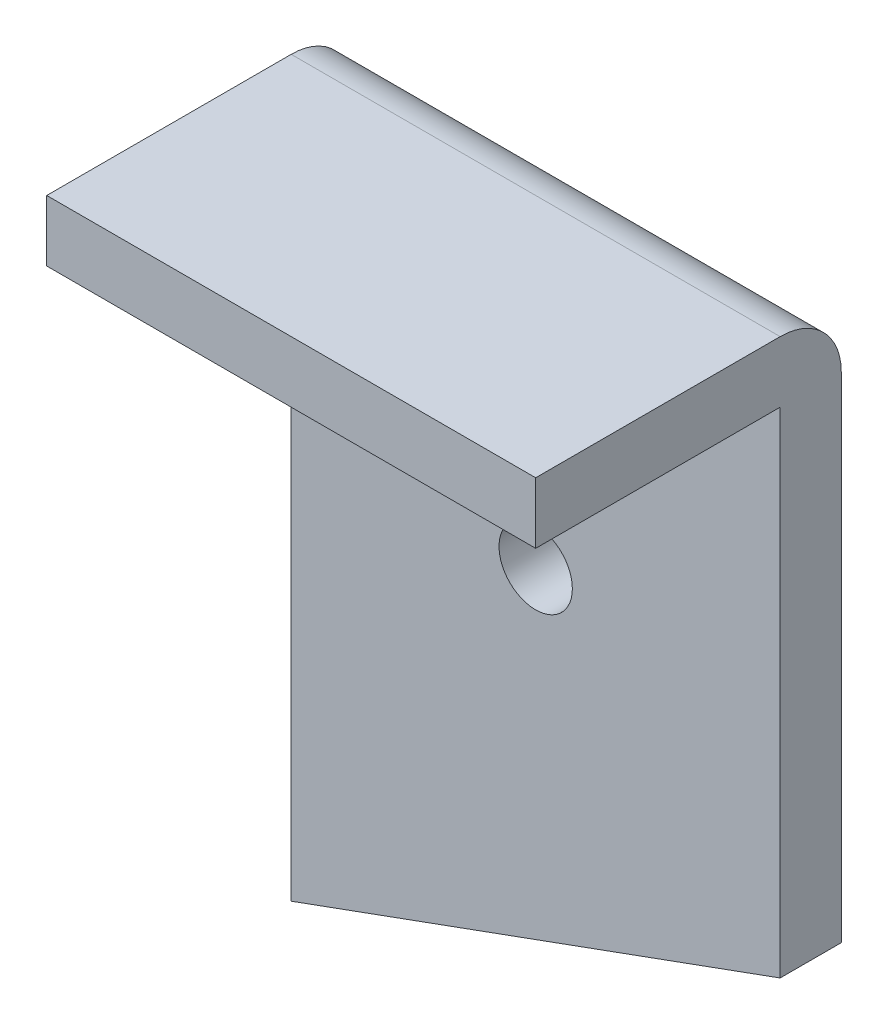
ISO-10303-21;
HEADER;
FILE_DESCRIPTION(('STEP AP214'),'2;1');
FILE_NAME('part.step','',(''),(''),'','','');
FILE_SCHEMA(('AUTOMOTIVE_DESIGN { 1 0 10303 214 1 1 1 1 }'));
ENDSEC;
DATA;
#1=APPLICATION_CONTEXT('core data for automotive mechanical design processes');
#2=APPLICATION_PROTOCOL_DEFINITION('international standard','automotive_design',2000,#1);
#3=PRODUCT_CONTEXT('',#1,'mechanical');
#4=PRODUCT('Part','Part','',(#3));
#5=PRODUCT_RELATED_PRODUCT_CATEGORY('part','',(#4));
#6=PRODUCT_DEFINITION_FORMATION('','',#4);
#7=PRODUCT_DEFINITION_CONTEXT('part definition',#1,'design');
#8=PRODUCT_DEFINITION('design','',#6,#7);
#9=PRODUCT_DEFINITION_SHAPE('','',#8);
#10=(LENGTH_UNIT() NAMED_UNIT(*) SI_UNIT(.MILLI.,.METRE.));
#11=(NAMED_UNIT(*) PLANE_ANGLE_UNIT() SI_UNIT($,.RADIAN.));
#12=(NAMED_UNIT(*) SI_UNIT($,.STERADIAN.) SOLID_ANGLE_UNIT());
#13=UNCERTAINTY_MEASURE_WITH_UNIT(LENGTH_MEASURE(1.E-05),#10,'distance_accuracy_value','');
#14=(GEOMETRIC_REPRESENTATION_CONTEXT(3) GLOBAL_UNCERTAINTY_ASSIGNED_CONTEXT((#13)) GLOBAL_UNIT_ASSIGNED_CONTEXT((#10,
#11,#12)) REPRESENTATION_CONTEXT('',''));
#15=CARTESIAN_POINT('',(0.,0.,0.));
#16=DIRECTION('',(0.,0.,1.));
#17=DIRECTION('',(1.,0.,0.));
#18=AXIS2_PLACEMENT_3D('',#15,#16,#17);
#19=CARTESIAN_POINT('',(0.,0.,9.99999999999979));
#20=DIRECTION('',(0.,0.,1.));
#21=DIRECTION('',(1.,0.,0.));
#22=AXIS2_PLACEMENT_3D('',#19,#20,#21);
#23=PLANE('',#22);
#24=DIRECTION('',(1.,0.,0.));
#25=VECTOR('',#24,1.);
#26=CARTESIAN_POINT('',(0.,-9.99999999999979,10.0000000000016));
#27=LINE('',#26,#25);
#28=CARTESIAN_POINT('',(0.,-9.99999999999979,10.0000000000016));
#29=VERTEX_POINT('',#28);
#30=CARTESIAN_POINT('',(80.,-9.99999999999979,9.99999999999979));
#31=VERTEX_POINT('',#30);
#32=EDGE_CURVE('E93',#29,#31,#27,.T.);
#33=ORIENTED_EDGE('',*,*,#32,.F.);
#34=DIRECTION('',(0.,-1.,0.));
#35=VECTOR('',#34,1.);
#36=CARTESIAN_POINT('',(0.,0.,9.99999999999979));
#37=LINE('',#36,#35);
#38=CARTESIAN_POINT('',(0.,-120.,10.0000000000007));
#39=VERTEX_POINT('',#38);
#40=EDGE_CURVE('E144',#29,#39,#37,.T.);
#41=ORIENTED_EDGE('',*,*,#40,.T.);
#42=DIRECTION('',(0.939692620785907,0.342020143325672,0.));
#43=VECTOR('',#42,1.);
#44=CARTESIAN_POINT('',(0.,-120.,10.0000000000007));
#45=LINE('',#44,#43);
#46=CARTESIAN_POINT('',(80.0000000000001,-90.882381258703,10.0000000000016));
#47=VERTEX_POINT('',#46);
#48=EDGE_CURVE('E96',#39,#47,#45,.T.);
#49=ORIENTED_EDGE('',*,*,#48,.T.);
#50=DIRECTION('',(0.,1.,0.));
#51=VECTOR('',#50,1.);
#52=CARTESIAN_POINT('',(80.,0.,9.99999999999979));
#53=LINE('',#52,#51);
#54=EDGE_CURVE('E90',#47,#31,#53,.T.);
#55=ORIENTED_EDGE('',*,*,#54,.T.);
#56=EDGE_LOOP('',(#33,#41,#49,#55));
#57=FACE_BOUND('',#56,.T.);
#58=CARTESIAN_POINT('',(40.,-52.7205953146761,9.99999999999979));
#59=DIRECTION('',(0.,0.,1.));
#60=DIRECTION('',(1.,0.,0.));
#61=AXIS2_PLACEMENT_3D('',#58,#59,#60);
#62=CIRCLE('',#61,6.);
#63=CARTESIAN_POINT('',(46.,-52.7205953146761,9.99999999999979));
#64=VERTEX_POINT('',#63);
#65=EDGE_CURVE('E162',#64,#64,#62,.T.);
#66=ORIENTED_EDGE('',*,*,#65,.F.);
#67=EDGE_LOOP('',(#66));
#68=FACE_BOUND('',#67,.T.);
#69=ADVANCED_FACE('F33',(#57,#68),#23,.T.);
#70=CARTESIAN_POINT('',(0.,0.,0.));
#71=DIRECTION('',(0.,0.,1.));
#72=DIRECTION('',(1.,0.,0.));
#73=AXIS2_PLACEMENT_3D('',#70,#71,#72);
#74=PLANE('',#73);
#75=DIRECTION('',(0.,-1.,0.));
#76=VECTOR('',#75,1.);
#77=CARTESIAN_POINT('',(0.,0.,0.));
#78=LINE('',#77,#76);
#79=CARTESIAN_POINT('',(0.,-10.,0.));
#80=VERTEX_POINT('',#79);
#81=CARTESIAN_POINT('',(0.,-120.,1.77635683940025E-12));
#82=VERTEX_POINT('',#81);
#83=EDGE_CURVE('E161',#80,#82,#78,.T.);
#84=ORIENTED_EDGE('',*,*,#83,.F.);
#85=DIRECTION('',(-1.,0.,0.));
#86=VECTOR('',#85,1.);
#87=CARTESIAN_POINT('',(0.,-10.,0.));
#88=LINE('',#87,#86);
#89=CARTESIAN_POINT('',(80.,-10.,0.));
#90=VERTEX_POINT('',#89);
#91=EDGE_CURVE('E41',#80,#90,#88,.F.);
#92=ORIENTED_EDGE('',*,*,#91,.T.);
#93=DIRECTION('',(0.,1.,0.));
#94=VECTOR('',#93,1.);
#95=CARTESIAN_POINT('',(80.0000000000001,0.,0.));
#96=LINE('',#95,#94);
#97=CARTESIAN_POINT('',(80.,-90.8823812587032,1.77635683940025E-12));
#98=VERTEX_POINT('',#97);
#99=EDGE_CURVE('E146',#98,#90,#96,.T.);
#100=ORIENTED_EDGE('',*,*,#99,.F.);
#101=DIRECTION('',(0.939692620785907,0.342020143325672,0.));
#102=VECTOR('',#101,1.);
#103=CARTESIAN_POINT('',(0.,-120.,1.77635683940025E-12));
#104=LINE('',#103,#102);
#105=EDGE_CURVE('E160',#82,#98,#104,.T.);
#106=ORIENTED_EDGE('',*,*,#105,.F.);
#107=EDGE_LOOP('',(#84,#92,#100,#106));
#108=FACE_BOUND('',#107,.T.);
#109=CARTESIAN_POINT('',(40.,-52.7205953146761,0.));
#110=DIRECTION('',(0.,0.,1.));
#111=DIRECTION('',(1.,0.,0.));
#112=AXIS2_PLACEMENT_3D('',#109,#110,#111);
#113=CIRCLE('',#112,6.);
#114=CARTESIAN_POINT('',(46.,-52.7205953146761,0.));
#115=VERTEX_POINT('',#114);
#116=EDGE_CURVE('E118',#115,#115,#113,.T.);
#117=ORIENTED_EDGE('',*,*,#116,.T.);
#118=EDGE_LOOP('',(#117));
#119=FACE_BOUND('',#118,.T.);
#120=ADVANCED_FACE('F184',(#108,#119),#74,.F.);
#121=CARTESIAN_POINT('',(0.,0.,9.99999999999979));
#122=DIRECTION('',(1.,0.,0.));
#123=DIRECTION('',(0.,1.,0.));
#124=AXIS2_PLACEMENT_3D('',#121,#122,#123);
#125=PLANE('',#124);
#126=DIRECTION('',(0.,0.,-1.));
#127=VECTOR('',#126,1.);
#128=CARTESIAN_POINT('',(0.,0.,9.99999999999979));
#129=LINE('',#128,#127);
#130=CARTESIAN_POINT('',(0.,0.,49.9999999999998));
#131=VERTEX_POINT('',#130);
#132=CARTESIAN_POINT('',(0.,0.,9.99999999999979));
#133=VERTEX_POINT('',#132);
#134=EDGE_CURVE('E101',#131,#133,#129,.T.);
#135=ORIENTED_EDGE('',*,*,#134,.T.);
#136=CARTESIAN_POINT('',(0.,-9.99999999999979,10.0000000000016));
#137=DIRECTION('',(1.,0.,0.));
#138=DIRECTION('',(0.,1.,0.));
#139=AXIS2_PLACEMENT_3D('',#136,#137,#138);
#140=CIRCLE('',#139,10.);
#141=EDGE_CURVE('E55',#133,#80,#140,.F.);
#142=ORIENTED_EDGE('',*,*,#141,.T.);
#143=ORIENTED_EDGE('',*,*,#83,.T.);
#144=DIRECTION('',(0.,0.,-1.));
#145=VECTOR('',#144,1.);
#146=CARTESIAN_POINT('',(0.,-120.,10.0000000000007));
#147=LINE('',#146,#145);
#148=EDGE_CURVE('E131',#39,#82,#147,.T.);
#149=ORIENTED_EDGE('',*,*,#148,.F.);
#150=ORIENTED_EDGE('',*,*,#40,.F.);
#151=DIRECTION('',(0.,0.,-1.));
#152=VECTOR('',#151,1.);
#153=CARTESIAN_POINT('',(0.,-9.99999999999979,49.9999999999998));
#154=LINE('',#153,#152);
#155=CARTESIAN_POINT('',(0.,-9.99999999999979,49.9999999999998));
#156=VERTEX_POINT('',#155);
#157=EDGE_CURVE('E110',#156,#29,#154,.T.);
#158=ORIENTED_EDGE('',*,*,#157,.F.);
#159=DIRECTION('',(0.,-1.,0.));
#160=VECTOR('',#159,1.);
#161=CARTESIAN_POINT('',(0.,0.,49.9999999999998));
#162=LINE('',#161,#160);
#163=EDGE_CURVE('E111',#131,#156,#162,.T.);
#164=ORIENTED_EDGE('',*,*,#163,.F.);
#165=EDGE_LOOP('',(#135,#142,#143,#149,#150,#158,#164));
#166=FACE_BOUND('',#165,.T.);
#167=ADVANCED_FACE('F35',(#166),#125,.F.);
#168=CARTESIAN_POINT('',(0.,-120.,10.0000000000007));
#169=DIRECTION('',(-0.342020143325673,0.939692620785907,0.));
#170=DIRECTION('',(-0.939692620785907,-0.342020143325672,0.));
#171=AXIS2_PLACEMENT_3D('',#168,#169,#170);
#172=PLANE('',#171);
#173=ORIENTED_EDGE('',*,*,#105,.T.);
#174=DIRECTION('',(0.,0.,-1.));
#175=VECTOR('',#174,1.);
#176=CARTESIAN_POINT('',(80.0000000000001,-90.882381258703,10.0000000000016));
#177=LINE('',#176,#175);
#178=EDGE_CURVE('E136',#47,#98,#177,.T.);
#179=ORIENTED_EDGE('',*,*,#178,.F.);
#180=ORIENTED_EDGE('',*,*,#48,.F.);
#181=ORIENTED_EDGE('',*,*,#148,.T.);
#182=EDGE_LOOP('',(#173,#179,#180,#181));
#183=FACE_BOUND('',#182,.T.);
#184=ADVANCED_FACE('F177',(#183),#172,.F.);
#185=CARTESIAN_POINT('',(80.,0.,9.99999999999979));
#186=DIRECTION('',(-1.,0.,0.));
#187=DIRECTION('',(0.,-1.,0.));
#188=AXIS2_PLACEMENT_3D('',#185,#186,#187);
#189=PLANE('',#188);
#190=ORIENTED_EDGE('',*,*,#99,.T.);
#191=CARTESIAN_POINT('',(80.,-9.99999999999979,9.99999999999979));
#192=DIRECTION('',(-1.,0.,0.));
#193=DIRECTION('',(0.,-1.,0.));
#194=AXIS2_PLACEMENT_3D('',#191,#192,#193);
#195=CIRCLE('',#194,10.);
#196=CARTESIAN_POINT('',(80.,0.,9.99999999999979));
#197=VERTEX_POINT('',#196);
#198=EDGE_CURVE('E11',#90,#197,#195,.F.);
#199=ORIENTED_EDGE('',*,*,#198,.T.);
#200=DIRECTION('',(0.,0.,-1.));
#201=VECTOR('',#200,1.);
#202=CARTESIAN_POINT('',(80.,0.,9.99999999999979));
#203=LINE('',#202,#201);
#204=CARTESIAN_POINT('',(80.,0.,49.9999999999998));
#205=VERTEX_POINT('',#204);
#206=EDGE_CURVE('E140',#205,#197,#203,.T.);
#207=ORIENTED_EDGE('',*,*,#206,.F.);
#208=DIRECTION('',(0.,1.,0.));
#209=VECTOR('',#208,1.);
#210=CARTESIAN_POINT('',(80.,0.,49.9999999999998));
#211=LINE('',#210,#209);
#212=CARTESIAN_POINT('',(80.,-10.,49.9999999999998));
#213=VERTEX_POINT('',#212);
#214=EDGE_CURVE('E115',#213,#205,#211,.T.);
#215=ORIENTED_EDGE('',*,*,#214,.F.);
#216=DIRECTION('',(0.,0.,-1.));
#217=VECTOR('',#216,1.);
#218=CARTESIAN_POINT('',(80.,-10.,49.9999999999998));
#219=LINE('',#218,#217);
#220=EDGE_CURVE('E107',#213,#31,#219,.T.);
#221=ORIENTED_EDGE('',*,*,#220,.T.);
#222=ORIENTED_EDGE('',*,*,#54,.F.);
#223=ORIENTED_EDGE('',*,*,#178,.T.);
#224=EDGE_LOOP('',(#190,#199,#207,#215,#221,#222,#223));
#225=FACE_BOUND('',#224,.T.);
#226=ADVANCED_FACE('F113',(#225),#189,.F.);
#227=CARTESIAN_POINT('',(0.,0.,9.99999999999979));
#228=DIRECTION('',(0.,-1.,0.));
#229=DIRECTION('',(0.,0.,-1.));
#230=AXIS2_PLACEMENT_3D('',#227,#228,#229);
#231=PLANE('',#230);
#232=ORIENTED_EDGE('',*,*,#206,.T.);
#233=DIRECTION('',(-1.,0.,0.));
#234=VECTOR('',#233,1.);
#235=CARTESIAN_POINT('',(0.,0.,9.99999999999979));
#236=LINE('',#235,#234);
#237=EDGE_CURVE('E128',#197,#133,#236,.T.);
#238=ORIENTED_EDGE('',*,*,#237,.T.);
#239=ORIENTED_EDGE('',*,*,#134,.F.);
#240=DIRECTION('',(-1.,0.,0.));
#241=VECTOR('',#240,1.);
#242=CARTESIAN_POINT('',(0.,0.,49.9999999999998));
#243=LINE('',#242,#241);
#244=EDGE_CURVE('E116',#205,#131,#243,.T.);
#245=ORIENTED_EDGE('',*,*,#244,.F.);
#246=EDGE_LOOP('',(#232,#238,#239,#245));
#247=FACE_BOUND('',#246,.T.);
#248=ADVANCED_FACE('F155',(#247),#231,.F.);
#249=CARTESIAN_POINT('',(40.,-52.7205953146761,9.99999999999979));
#250=DIRECTION('',(0.,0.,-1.));
#251=DIRECTION('',(-1.,0.,0.));
#252=AXIS2_PLACEMENT_3D('',#249,#250,#251);
#253=CYLINDRICAL_SURFACE('',#252,6.);
#254=ORIENTED_EDGE('',*,*,#65,.T.);
#255=EDGE_LOOP('',(#254));
#256=FACE_BOUND('',#255,.T.);
#257=ORIENTED_EDGE('',*,*,#116,.F.);
#258=EDGE_LOOP('',(#257));
#259=FACE_BOUND('',#258,.T.);
#260=ADVANCED_FACE('F194',(#256,#259),#253,.F.);
#261=CARTESIAN_POINT('',(0.,-9.99999999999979,49.9999999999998));
#262=DIRECTION('',(0.,1.,0.));
#263=DIRECTION('',(-1.,0.,0.));
#264=AXIS2_PLACEMENT_3D('',#261,#262,#263);
#265=PLANE('',#264);
#266=ORIENTED_EDGE('',*,*,#32,.T.);
#267=ORIENTED_EDGE('',*,*,#220,.F.);
#268=DIRECTION('',(1.,0.,0.));
#269=VECTOR('',#268,1.);
#270=CARTESIAN_POINT('',(0.,-9.99999999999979,49.9999999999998));
#271=LINE('',#270,#269);
#272=EDGE_CURVE('E170',#156,#213,#271,.T.);
#273=ORIENTED_EDGE('',*,*,#272,.F.);
#274=ORIENTED_EDGE('',*,*,#157,.T.);
#275=EDGE_LOOP('',(#266,#267,#273,#274));
#276=FACE_BOUND('',#275,.T.);
#277=ADVANCED_FACE('F106',(#276),#265,.F.);
#278=CARTESIAN_POINT('',(0.,-9.99999999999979,49.9999999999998));
#279=DIRECTION('',(0.,0.,1.));
#280=DIRECTION('',(1.,0.,0.));
#281=AXIS2_PLACEMENT_3D('',#278,#279,#280);
#282=PLANE('',#281);
#283=ORIENTED_EDGE('',*,*,#163,.T.);
#284=ORIENTED_EDGE('',*,*,#272,.T.);
#285=ORIENTED_EDGE('',*,*,#214,.T.);
#286=ORIENTED_EDGE('',*,*,#244,.T.);
#287=EDGE_LOOP('',(#283,#284,#285,#286));
#288=FACE_BOUND('',#287,.T.);
#289=ADVANCED_FACE('F176',(#288),#282,.T.);
#290=CARTESIAN_POINT('',(0.,-9.99999999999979,10.0000000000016));
#291=DIRECTION('',(-1.,0.,0.));
#292=DIRECTION('',(0.,0.,1.));
#293=AXIS2_PLACEMENT_3D('',#290,#291,#292);
#294=CYLINDRICAL_SURFACE('',#293,10.);
#295=ORIENTED_EDGE('',*,*,#198,.F.);
#296=ORIENTED_EDGE('',*,*,#91,.F.);
#297=ORIENTED_EDGE('',*,*,#141,.F.);
#298=ORIENTED_EDGE('',*,*,#237,.F.);
#299=EDGE_LOOP('',(#295,#296,#297,#298));
#300=FACE_BOUND('',#299,.T.);
#301=ADVANCED_FACE('F158',(#300),#294,.T.);
#302=CLOSED_SHELL('',(#69,#120,#167,#184,#226,#248,#260,#277,#289,#301));
#303=MANIFOLD_SOLID_BREP('B2',#302);
#304=ADVANCED_BREP_SHAPE_REPRESENTATION('',(#18,#303),#14);
#305=SHAPE_DEFINITION_REPRESENTATION(#9,#304);
ENDSEC;
END-ISO-10303-21;
